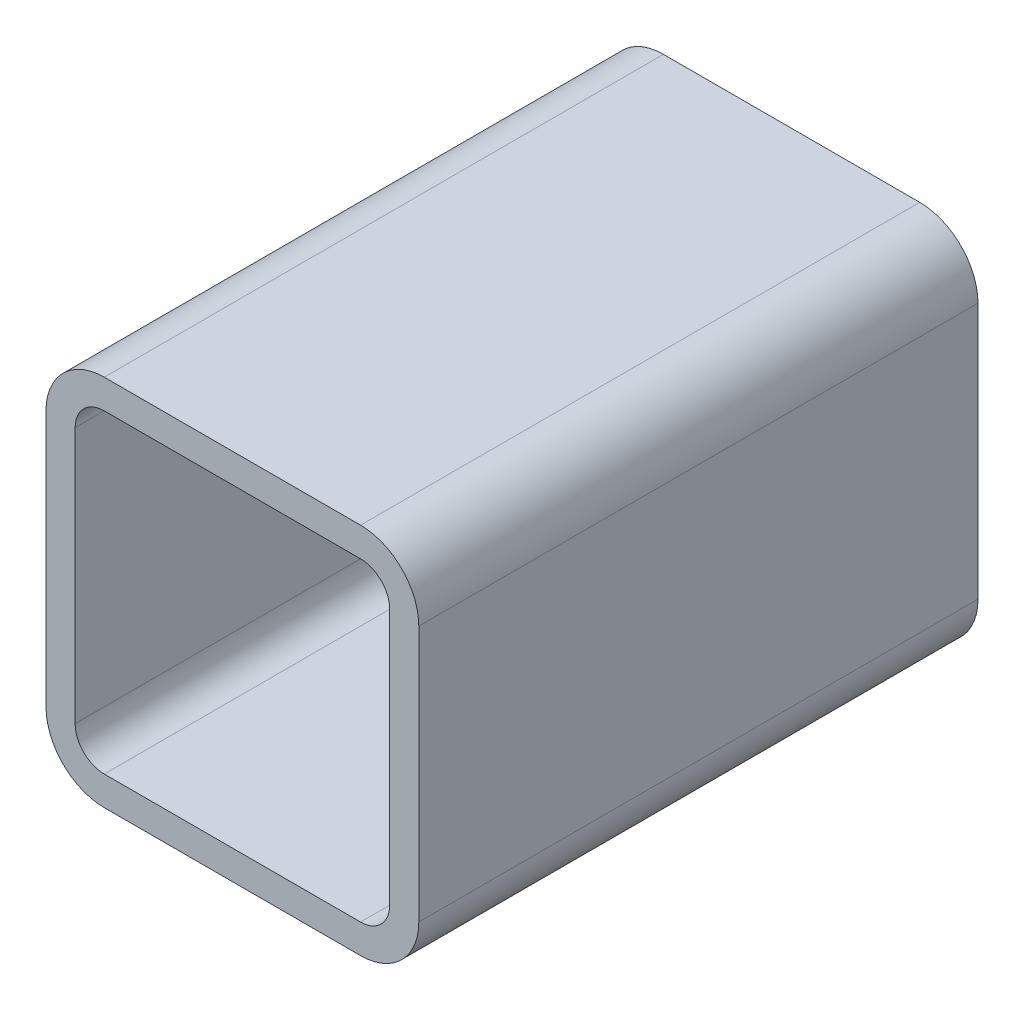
ISO-10303-21;
HEADER;
FILE_DESCRIPTION(('STEP AP214'),'2;1');
FILE_NAME('part.step','',(''),(''),'','','');
FILE_SCHEMA(('AUTOMOTIVE_DESIGN { 1 0 10303 214 1 1 1 1 }'));
ENDSEC;
DATA;
#1=APPLICATION_CONTEXT('core data for automotive mechanical design processes');
#2=APPLICATION_PROTOCOL_DEFINITION('international standard','automotive_design',2000,#1);
#3=PRODUCT_CONTEXT('',#1,'mechanical');
#4=PRODUCT('Part','Part','',(#3));
#5=PRODUCT_RELATED_PRODUCT_CATEGORY('part','',(#4));
#6=PRODUCT_DEFINITION_FORMATION('','',#4);
#7=PRODUCT_DEFINITION_CONTEXT('part definition',#1,'design');
#8=PRODUCT_DEFINITION('design','',#6,#7);
#9=PRODUCT_DEFINITION_SHAPE('','',#8);
#10=(LENGTH_UNIT() NAMED_UNIT(*) SI_UNIT(.MILLI.,.METRE.));
#11=(NAMED_UNIT(*) PLANE_ANGLE_UNIT() SI_UNIT($,.RADIAN.));
#12=(NAMED_UNIT(*) SI_UNIT($,.STERADIAN.) SOLID_ANGLE_UNIT());
#13=UNCERTAINTY_MEASURE_WITH_UNIT(LENGTH_MEASURE(1.E-05),#10,'distance_accuracy_value','');
#14=(GEOMETRIC_REPRESENTATION_CONTEXT(3) GLOBAL_UNCERTAINTY_ASSIGNED_CONTEXT((#13)) GLOBAL_UNIT_ASSIGNED_CONTEXT((#10,
#11,#12)) REPRESENTATION_CONTEXT('',''));
#15=CARTESIAN_POINT('',(0.,0.,0.));
#16=DIRECTION('',(0.,0.,1.));
#17=DIRECTION('',(1.,0.,0.));
#18=AXIS2_PLACEMENT_3D('',#15,#16,#17);
#19=CARTESIAN_POINT('',(33.1409404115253,173.416130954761,304.8));
#20=DIRECTION('',(0.,0.,1.));
#21=DIRECTION('',(1.,0.,0.));
#22=AXIS2_PLACEMENT_3D('',#19,#20,#21);
#23=PLANE('',#22);
#24=CARTESIAN_POINT('',(33.1409404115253,173.416130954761,304.8));
#25=DIRECTION('',(0.,0.,1.));
#26=DIRECTION('',(1.,0.,0.));
#27=AXIS2_PLACEMENT_3D('',#24,#25,#26);
#28=CIRCLE('',#27,31.75);
#29=CARTESIAN_POINT('',(33.1409404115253,205.166130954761,304.8));
#30=VERTEX_POINT('',#29);
#31=CARTESIAN_POINT('',(1.3909404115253,173.416130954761,304.8));
#32=VERTEX_POINT('',#31);
#33=EDGE_CURVE('E211',#30,#32,#28,.T.);
#34=ORIENTED_EDGE('',*,*,#33,.T.);
#35=DIRECTION('',(0.,-1.,0.));
#36=VECTOR('',#35,1.);
#37=CARTESIAN_POINT('',(1.3909404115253,33.7161309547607,304.8));
#38=LINE('',#37,#36);
#39=CARTESIAN_POINT('',(1.3909404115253,33.7161309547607,304.8));
#40=VERTEX_POINT('',#39);
#41=EDGE_CURVE('E214',#32,#40,#38,.T.);
#42=ORIENTED_EDGE('',*,*,#41,.T.);
#43=CARTESIAN_POINT('',(33.1409404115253,33.7161309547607,304.8));
#44=DIRECTION('',(0.,0.,1.));
#45=DIRECTION('',(1.,0.,0.));
#46=AXIS2_PLACEMENT_3D('',#43,#44,#45);
#47=CIRCLE('',#46,31.75);
#48=CARTESIAN_POINT('',(33.1409404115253,1.96613095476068,304.8));
#49=VERTEX_POINT('',#48);
#50=EDGE_CURVE('E217',#40,#49,#47,.T.);
#51=ORIENTED_EDGE('',*,*,#50,.T.);
#52=DIRECTION('',(1.,0.,0.));
#53=VECTOR('',#52,1.);
#54=CARTESIAN_POINT('',(172.840940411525,1.96613095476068,304.8));
#55=LINE('',#54,#53);
#56=CARTESIAN_POINT('',(172.840940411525,1.96613095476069,304.8));
#57=VERTEX_POINT('',#56);
#58=EDGE_CURVE('E219',#49,#57,#55,.T.);
#59=ORIENTED_EDGE('',*,*,#58,.T.);
#60=CARTESIAN_POINT('',(172.840940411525,33.7161309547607,304.8));
#61=DIRECTION('',(0.,0.,1.));
#62=DIRECTION('',(1.,0.,0.));
#63=AXIS2_PLACEMENT_3D('',#60,#61,#62);
#64=CIRCLE('',#63,31.75);
#65=CARTESIAN_POINT('',(204.590940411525,33.7161309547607,304.8));
#66=VERTEX_POINT('',#65);
#67=EDGE_CURVE('E221',#57,#66,#64,.T.);
#68=ORIENTED_EDGE('',*,*,#67,.T.);
#69=DIRECTION('',(0.,1.,0.));
#70=VECTOR('',#69,1.);
#71=CARTESIAN_POINT('',(204.590940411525,173.416130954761,304.8));
#72=LINE('',#71,#70);
#73=CARTESIAN_POINT('',(204.590940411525,173.416130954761,304.8));
#74=VERTEX_POINT('',#73);
#75=EDGE_CURVE('E223',#66,#74,#72,.T.);
#76=ORIENTED_EDGE('',*,*,#75,.T.);
#77=CARTESIAN_POINT('',(172.840940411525,173.416130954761,304.8));
#78=DIRECTION('',(0.,0.,1.));
#79=DIRECTION('',(1.,0.,0.));
#80=AXIS2_PLACEMENT_3D('',#77,#78,#79);
#81=CIRCLE('',#80,31.75);
#82=CARTESIAN_POINT('',(172.840940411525,205.166130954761,304.8));
#83=VERTEX_POINT('',#82);
#84=EDGE_CURVE('E225',#74,#83,#81,.T.);
#85=ORIENTED_EDGE('',*,*,#84,.T.);
#86=DIRECTION('',(-1.,0.,0.));
#87=VECTOR('',#86,1.);
#88=CARTESIAN_POINT('',(33.1409404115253,205.166130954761,304.8));
#89=LINE('',#88,#87);
#90=EDGE_CURVE('E227',#83,#30,#89,.T.);
#91=ORIENTED_EDGE('',*,*,#90,.T.);
#92=EDGE_LOOP('',(#34,#42,#51,#59,#68,#76,#85,#91));
#93=FACE_BOUND('',#92,.T.);
#94=DIRECTION('',(0.,-1.,0.));
#95=VECTOR('',#94,1.);
#96=CARTESIAN_POINT('',(17.2659404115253,33.7161309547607,304.8));
#97=LINE('',#96,#95);
#98=CARTESIAN_POINT('',(17.2659404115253,173.416130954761,304.8));
#99=VERTEX_POINT('',#98);
#100=CARTESIAN_POINT('',(17.2659404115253,33.7161309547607,304.8));
#101=VERTEX_POINT('',#100);
#102=EDGE_CURVE('E154',#99,#101,#97,.T.);
#103=ORIENTED_EDGE('',*,*,#102,.F.);
#104=CARTESIAN_POINT('',(33.1409404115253,173.416130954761,304.8));
#105=DIRECTION('',(0.,0.,1.));
#106=DIRECTION('',(1.,0.,0.));
#107=AXIS2_PLACEMENT_3D('',#104,#105,#106);
#108=CIRCLE('',#107,15.875);
#109=CARTESIAN_POINT('',(33.1409404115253,189.291130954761,304.8));
#110=VERTEX_POINT('',#109);
#111=EDGE_CURVE('E146',#110,#99,#108,.T.);
#112=ORIENTED_EDGE('',*,*,#111,.F.);
#113=DIRECTION('',(-1.,0.,0.));
#114=VECTOR('',#113,1.);
#115=CARTESIAN_POINT('',(33.1409404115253,189.291130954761,304.8));
#116=LINE('',#115,#114);
#117=CARTESIAN_POINT('',(172.840940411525,189.291130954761,304.8));
#118=VERTEX_POINT('',#117);
#119=EDGE_CURVE('E179',#118,#110,#116,.T.);
#120=ORIENTED_EDGE('',*,*,#119,.F.);
#121=CARTESIAN_POINT('',(172.840940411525,173.416130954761,304.8));
#122=DIRECTION('',(0.,0.,1.));
#123=DIRECTION('',(1.,0.,0.));
#124=AXIS2_PLACEMENT_3D('',#121,#122,#123);
#125=CIRCLE('',#124,15.875);
#126=CARTESIAN_POINT('',(188.715940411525,173.416130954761,304.8));
#127=VERTEX_POINT('',#126);
#128=EDGE_CURVE('E177',#127,#118,#125,.T.);
#129=ORIENTED_EDGE('',*,*,#128,.F.);
#130=DIRECTION('',(0.,1.,0.));
#131=VECTOR('',#130,1.);
#132=CARTESIAN_POINT('',(188.715940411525,173.416130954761,304.8));
#133=LINE('',#132,#131);
#134=CARTESIAN_POINT('',(188.715940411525,33.7161309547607,304.8));
#135=VERTEX_POINT('',#134);
#136=EDGE_CURVE('E175',#135,#127,#133,.T.);
#137=ORIENTED_EDGE('',*,*,#136,.F.);
#138=CARTESIAN_POINT('',(172.840940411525,33.7161309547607,304.8));
#139=DIRECTION('',(0.,0.,1.));
#140=DIRECTION('',(1.,0.,0.));
#141=AXIS2_PLACEMENT_3D('',#138,#139,#140);
#142=CIRCLE('',#141,15.875);
#143=CARTESIAN_POINT('',(172.840940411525,17.8411309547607,304.8));
#144=VERTEX_POINT('',#143);
#145=EDGE_CURVE('E173',#144,#135,#142,.T.);
#146=ORIENTED_EDGE('',*,*,#145,.F.);
#147=DIRECTION('',(1.,0.,0.));
#148=VECTOR('',#147,1.);
#149=CARTESIAN_POINT('',(172.840940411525,17.8411309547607,304.8));
#150=LINE('',#149,#148);
#151=CARTESIAN_POINT('',(33.1409404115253,17.8411309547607,304.8));
#152=VERTEX_POINT('',#151);
#153=EDGE_CURVE('E169',#152,#144,#150,.T.);
#154=ORIENTED_EDGE('',*,*,#153,.F.);
#155=CARTESIAN_POINT('',(33.1409404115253,33.7161309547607,304.8));
#156=DIRECTION('',(0.,0.,1.));
#157=DIRECTION('',(1.,0.,0.));
#158=AXIS2_PLACEMENT_3D('',#155,#156,#157);
#159=CIRCLE('',#158,15.875);
#160=EDGE_CURVE('E167',#101,#152,#159,.T.);
#161=ORIENTED_EDGE('',*,*,#160,.F.);
#162=EDGE_LOOP('',(#103,#112,#120,#129,#137,#146,#154,#161));
#163=FACE_BOUND('',#162,.T.);
#164=ADVANCED_FACE('F33',(#93,#163),#23,.T.);
#165=CARTESIAN_POINT('',(33.1409404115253,173.416130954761,0.));
#166=DIRECTION('',(0.,0.,1.));
#167=DIRECTION('',(1.,0.,0.));
#168=AXIS2_PLACEMENT_3D('',#165,#166,#167);
#169=PLANE('',#168);
#170=CARTESIAN_POINT('',(33.1409404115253,173.416130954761,0.));
#171=DIRECTION('',(0.,0.,1.));
#172=DIRECTION('',(1.,0.,0.));
#173=AXIS2_PLACEMENT_3D('',#170,#171,#172);
#174=CIRCLE('',#173,31.75);
#175=CARTESIAN_POINT('',(33.1409404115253,205.166130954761,0.));
#176=VERTEX_POINT('',#175);
#177=CARTESIAN_POINT('',(1.3909404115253,173.416130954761,0.));
#178=VERTEX_POINT('',#177);
#179=EDGE_CURVE('E162',#176,#178,#174,.T.);
#180=ORIENTED_EDGE('',*,*,#179,.F.);
#181=DIRECTION('',(-1.,0.,0.));
#182=VECTOR('',#181,1.);
#183=CARTESIAN_POINT('',(33.1409404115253,205.166130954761,0.));
#184=LINE('',#183,#182);
#185=CARTESIAN_POINT('',(172.840940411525,205.166130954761,0.));
#186=VERTEX_POINT('',#185);
#187=EDGE_CURVE('E215',#186,#176,#184,.T.);
#188=ORIENTED_EDGE('',*,*,#187,.F.);
#189=CARTESIAN_POINT('',(172.840940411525,173.416130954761,0.));
#190=DIRECTION('',(0.,0.,1.));
#191=DIRECTION('',(1.,0.,0.));
#192=AXIS2_PLACEMENT_3D('',#189,#190,#191);
#193=CIRCLE('',#192,31.75);
#194=CARTESIAN_POINT('',(204.590940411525,173.416130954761,0.));
#195=VERTEX_POINT('',#194);
#196=EDGE_CURVE('E242',#195,#186,#193,.T.);
#197=ORIENTED_EDGE('',*,*,#196,.F.);
#198=DIRECTION('',(0.,1.,0.));
#199=VECTOR('',#198,1.);
#200=CARTESIAN_POINT('',(204.590940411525,173.416130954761,0.));
#201=LINE('',#200,#199);
#202=CARTESIAN_POINT('',(204.590940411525,33.7161309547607,0.));
#203=VERTEX_POINT('',#202);
#204=EDGE_CURVE('E240',#203,#195,#201,.T.);
#205=ORIENTED_EDGE('',*,*,#204,.F.);
#206=CARTESIAN_POINT('',(172.840940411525,33.7161309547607,0.));
#207=DIRECTION('',(0.,0.,1.));
#208=DIRECTION('',(1.,0.,0.));
#209=AXIS2_PLACEMENT_3D('',#206,#207,#208);
#210=CIRCLE('',#209,31.75);
#211=CARTESIAN_POINT('',(172.840940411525,1.96613095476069,0.));
#212=VERTEX_POINT('',#211);
#213=EDGE_CURVE('E238',#212,#203,#210,.T.);
#214=ORIENTED_EDGE('',*,*,#213,.F.);
#215=DIRECTION('',(1.,0.,0.));
#216=VECTOR('',#215,1.);
#217=CARTESIAN_POINT('',(172.840940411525,1.96613095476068,0.));
#218=LINE('',#217,#216);
#219=CARTESIAN_POINT('',(33.1409404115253,1.96613095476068,0.));
#220=VERTEX_POINT('',#219);
#221=EDGE_CURVE('E236',#220,#212,#218,.T.);
#222=ORIENTED_EDGE('',*,*,#221,.F.);
#223=CARTESIAN_POINT('',(33.1409404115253,33.7161309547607,0.));
#224=DIRECTION('',(0.,0.,1.));
#225=DIRECTION('',(1.,0.,0.));
#226=AXIS2_PLACEMENT_3D('',#223,#224,#225);
#227=CIRCLE('',#226,31.75);
#228=CARTESIAN_POINT('',(1.3909404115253,33.7161309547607,0.));
#229=VERTEX_POINT('',#228);
#230=EDGE_CURVE('E234',#229,#220,#227,.T.);
#231=ORIENTED_EDGE('',*,*,#230,.F.);
#232=DIRECTION('',(0.,-1.,0.));
#233=VECTOR('',#232,1.);
#234=CARTESIAN_POINT('',(1.3909404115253,33.7161309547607,0.));
#235=LINE('',#234,#233);
#236=EDGE_CURVE('E232',#178,#229,#235,.T.);
#237=ORIENTED_EDGE('',*,*,#236,.F.);
#238=EDGE_LOOP('',(#180,#188,#197,#205,#214,#222,#231,#237));
#239=FACE_BOUND('',#238,.T.);
#240=CARTESIAN_POINT('',(33.1409404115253,173.416130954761,0.));
#241=DIRECTION('',(0.,0.,1.));
#242=DIRECTION('',(1.,0.,0.));
#243=AXIS2_PLACEMENT_3D('',#240,#241,#242);
#244=CIRCLE('',#243,15.875);
#245=CARTESIAN_POINT('',(33.1409404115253,189.291130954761,0.));
#246=VERTEX_POINT('',#245);
#247=CARTESIAN_POINT('',(17.2659404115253,173.416130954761,0.));
#248=VERTEX_POINT('',#247);
#249=EDGE_CURVE('E56',#246,#248,#244,.T.);
#250=ORIENTED_EDGE('',*,*,#249,.T.);
#251=DIRECTION('',(0.,-1.,0.));
#252=VECTOR('',#251,1.);
#253=CARTESIAN_POINT('',(17.2659404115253,33.7161309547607,0.));
#254=LINE('',#253,#252);
#255=CARTESIAN_POINT('',(17.2659404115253,33.7161309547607,0.));
#256=VERTEX_POINT('',#255);
#257=EDGE_CURVE('E161',#248,#256,#254,.T.);
#258=ORIENTED_EDGE('',*,*,#257,.T.);
#259=CARTESIAN_POINT('',(33.1409404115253,33.7161309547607,0.));
#260=DIRECTION('',(0.,0.,1.));
#261=DIRECTION('',(1.,0.,0.));
#262=AXIS2_PLACEMENT_3D('',#259,#260,#261);
#263=CIRCLE('',#262,15.875);
#264=CARTESIAN_POINT('',(33.1409404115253,17.8411309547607,0.));
#265=VERTEX_POINT('',#264);
#266=EDGE_CURVE('E183',#256,#265,#263,.T.);
#267=ORIENTED_EDGE('',*,*,#266,.T.);
#268=DIRECTION('',(1.,0.,0.));
#269=VECTOR('',#268,1.);
#270=CARTESIAN_POINT('',(172.840940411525,17.8411309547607,0.));
#271=LINE('',#270,#269);
#272=CARTESIAN_POINT('',(172.840940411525,17.8411309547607,0.));
#273=VERTEX_POINT('',#272);
#274=EDGE_CURVE('E186',#265,#273,#271,.T.);
#275=ORIENTED_EDGE('',*,*,#274,.T.);
#276=CARTESIAN_POINT('',(172.840940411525,33.7161309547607,0.));
#277=DIRECTION('',(0.,0.,1.));
#278=DIRECTION('',(1.,0.,0.));
#279=AXIS2_PLACEMENT_3D('',#276,#277,#278);
#280=CIRCLE('',#279,15.875);
#281=CARTESIAN_POINT('',(188.715940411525,33.7161309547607,0.));
#282=VERTEX_POINT('',#281);
#283=EDGE_CURVE('E189',#273,#282,#280,.T.);
#284=ORIENTED_EDGE('',*,*,#283,.T.);
#285=DIRECTION('',(0.,1.,0.));
#286=VECTOR('',#285,1.);
#287=CARTESIAN_POINT('',(188.715940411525,173.416130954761,0.));
#288=LINE('',#287,#286);
#289=CARTESIAN_POINT('',(188.715940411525,173.416130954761,0.));
#290=VERTEX_POINT('',#289);
#291=EDGE_CURVE('E192',#282,#290,#288,.T.);
#292=ORIENTED_EDGE('',*,*,#291,.T.);
#293=CARTESIAN_POINT('',(172.840940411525,173.416130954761,0.));
#294=DIRECTION('',(0.,0.,1.));
#295=DIRECTION('',(1.,0.,0.));
#296=AXIS2_PLACEMENT_3D('',#293,#294,#295);
#297=CIRCLE('',#296,15.875);
#298=CARTESIAN_POINT('',(172.840940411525,189.291130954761,0.));
#299=VERTEX_POINT('',#298);
#300=EDGE_CURVE('E195',#290,#299,#297,.T.);
#301=ORIENTED_EDGE('',*,*,#300,.T.);
#302=DIRECTION('',(-1.,0.,0.));
#303=VECTOR('',#302,1.);
#304=CARTESIAN_POINT('',(33.1409404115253,189.291130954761,0.));
#305=LINE('',#304,#303);
#306=EDGE_CURVE('E155',#299,#246,#305,.T.);
#307=ORIENTED_EDGE('',*,*,#306,.T.);
#308=EDGE_LOOP('',(#250,#258,#267,#275,#284,#292,#301,#307));
#309=FACE_BOUND('',#308,.T.);
#310=ADVANCED_FACE('F272',(#239,#309),#169,.F.);
#311=CARTESIAN_POINT('',(33.1409404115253,173.416130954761,304.8));
#312=DIRECTION('',(0.,0.,-1.));
#313=DIRECTION('',(-1.,0.,0.));
#314=AXIS2_PLACEMENT_3D('',#311,#312,#313);
#315=CYLINDRICAL_SURFACE('',#314,31.75);
#316=ORIENTED_EDGE('',*,*,#179,.T.);
#317=DIRECTION('',(0.,0.,-1.));
#318=VECTOR('',#317,1.);
#319=CARTESIAN_POINT('',(1.3909404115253,173.416130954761,304.8));
#320=LINE('',#319,#318);
#321=EDGE_CURVE('E11',#32,#178,#320,.T.);
#322=ORIENTED_EDGE('',*,*,#321,.F.);
#323=ORIENTED_EDGE('',*,*,#33,.F.);
#324=DIRECTION('',(0.,0.,-1.));
#325=VECTOR('',#324,1.);
#326=CARTESIAN_POINT('',(33.1409404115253,205.166130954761,304.8));
#327=LINE('',#326,#325);
#328=EDGE_CURVE('E229',#30,#176,#327,.T.);
#329=ORIENTED_EDGE('',*,*,#328,.T.);
#330=EDGE_LOOP('',(#316,#322,#323,#329));
#331=FACE_BOUND('',#330,.T.);
#332=ADVANCED_FACE('F35',(#331),#315,.T.);
#333=CARTESIAN_POINT('',(1.3909404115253,33.7161309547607,304.8));
#334=DIRECTION('',(1.,0.,0.));
#335=DIRECTION('',(0.,0.,-1.));
#336=AXIS2_PLACEMENT_3D('',#333,#334,#335);
#337=PLANE('',#336);
#338=ORIENTED_EDGE('',*,*,#236,.T.);
#339=DIRECTION('',(0.,0.,-1.));
#340=VECTOR('',#339,1.);
#341=CARTESIAN_POINT('',(1.3909404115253,33.7161309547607,304.8));
#342=LINE('',#341,#340);
#343=EDGE_CURVE('E41',#40,#229,#342,.T.);
#344=ORIENTED_EDGE('',*,*,#343,.F.);
#345=ORIENTED_EDGE('',*,*,#41,.F.);
#346=ORIENTED_EDGE('',*,*,#321,.T.);
#347=EDGE_LOOP('',(#338,#344,#345,#346));
#348=FACE_BOUND('',#347,.T.);
#349=ADVANCED_FACE('F289',(#348),#337,.F.);
#350=CARTESIAN_POINT('',(33.1409404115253,33.7161309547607,304.8));
#351=DIRECTION('',(0.,0.,-1.));
#352=DIRECTION('',(-1.,0.,0.));
#353=AXIS2_PLACEMENT_3D('',#350,#351,#352);
#354=CYLINDRICAL_SURFACE('',#353,31.75);
#355=ORIENTED_EDGE('',*,*,#230,.T.);
#356=DIRECTION('',(0.,0.,-1.));
#357=VECTOR('',#356,1.);
#358=CARTESIAN_POINT('',(33.1409404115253,1.96613095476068,304.8));
#359=LINE('',#358,#357);
#360=EDGE_CURVE('E259',#49,#220,#359,.T.);
#361=ORIENTED_EDGE('',*,*,#360,.F.);
#362=ORIENTED_EDGE('',*,*,#50,.F.);
#363=ORIENTED_EDGE('',*,*,#343,.T.);
#364=EDGE_LOOP('',(#355,#361,#362,#363));
#365=FACE_BOUND('',#364,.T.);
#366=ADVANCED_FACE('F266',(#365),#354,.T.);
#367=CARTESIAN_POINT('',(172.840940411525,1.96613095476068,304.8));
#368=DIRECTION('',(0.,1.,0.));
#369=DIRECTION('',(0.,0.,1.));
#370=AXIS2_PLACEMENT_3D('',#367,#368,#369);
#371=PLANE('',#370);
#372=ORIENTED_EDGE('',*,*,#221,.T.);
#373=DIRECTION('',(0.,0.,-1.));
#374=VECTOR('',#373,1.);
#375=CARTESIAN_POINT('',(172.840940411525,1.96613095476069,304.8));
#376=LINE('',#375,#374);
#377=EDGE_CURVE('E256',#57,#212,#376,.T.);
#378=ORIENTED_EDGE('',*,*,#377,.F.);
#379=ORIENTED_EDGE('',*,*,#58,.F.);
#380=ORIENTED_EDGE('',*,*,#360,.T.);
#381=EDGE_LOOP('',(#372,#378,#379,#380));
#382=FACE_BOUND('',#381,.T.);
#383=ADVANCED_FACE('F278',(#382),#371,.F.);
#384=CARTESIAN_POINT('',(172.840940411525,33.7161309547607,304.8));
#385=DIRECTION('',(0.,0.,-1.));
#386=DIRECTION('',(-1.,0.,0.));
#387=AXIS2_PLACEMENT_3D('',#384,#385,#386);
#388=CYLINDRICAL_SURFACE('',#387,31.75);
#389=ORIENTED_EDGE('',*,*,#213,.T.);
#390=DIRECTION('',(0.,0.,-1.));
#391=VECTOR('',#390,1.);
#392=CARTESIAN_POINT('',(204.590940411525,33.7161309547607,304.8));
#393=LINE('',#392,#391);
#394=EDGE_CURVE('E253',#66,#203,#393,.T.);
#395=ORIENTED_EDGE('',*,*,#394,.F.);
#396=ORIENTED_EDGE('',*,*,#67,.F.);
#397=ORIENTED_EDGE('',*,*,#377,.T.);
#398=EDGE_LOOP('',(#389,#395,#396,#397));
#399=FACE_BOUND('',#398,.T.);
#400=ADVANCED_FACE('F282',(#399),#388,.T.);
#401=CARTESIAN_POINT('',(204.590940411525,173.416130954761,304.8));
#402=DIRECTION('',(-1.,0.,0.));
#403=DIRECTION('',(0.,0.,1.));
#404=AXIS2_PLACEMENT_3D('',#401,#402,#403);
#405=PLANE('',#404);
#406=ORIENTED_EDGE('',*,*,#204,.T.);
#407=DIRECTION('',(0.,0.,-1.));
#408=VECTOR('',#407,1.);
#409=CARTESIAN_POINT('',(204.590940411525,173.416130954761,304.8));
#410=LINE('',#409,#408);
#411=EDGE_CURVE('E250',#74,#195,#410,.T.);
#412=ORIENTED_EDGE('',*,*,#411,.F.);
#413=ORIENTED_EDGE('',*,*,#75,.F.);
#414=ORIENTED_EDGE('',*,*,#394,.T.);
#415=EDGE_LOOP('',(#406,#412,#413,#414));
#416=FACE_BOUND('',#415,.T.);
#417=ADVANCED_FACE('F302',(#416),#405,.F.);
#418=CARTESIAN_POINT('',(172.840940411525,173.416130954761,304.8));
#419=DIRECTION('',(0.,0.,-1.));
#420=DIRECTION('',(-1.,0.,0.));
#421=AXIS2_PLACEMENT_3D('',#418,#419,#420);
#422=CYLINDRICAL_SURFACE('',#421,31.75);
#423=ORIENTED_EDGE('',*,*,#196,.T.);
#424=DIRECTION('',(0.,0.,-1.));
#425=VECTOR('',#424,1.);
#426=CARTESIAN_POINT('',(172.840940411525,205.166130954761,304.8));
#427=LINE('',#426,#425);
#428=EDGE_CURVE('E247',#83,#186,#427,.T.);
#429=ORIENTED_EDGE('',*,*,#428,.F.);
#430=ORIENTED_EDGE('',*,*,#84,.F.);
#431=ORIENTED_EDGE('',*,*,#411,.T.);
#432=EDGE_LOOP('',(#423,#429,#430,#431));
#433=FACE_BOUND('',#432,.T.);
#434=ADVANCED_FACE('F300',(#433),#422,.T.);
#435=CARTESIAN_POINT('',(33.1409404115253,205.166130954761,304.8));
#436=DIRECTION('',(0.,-1.,0.));
#437=DIRECTION('',(0.,0.,-1.));
#438=AXIS2_PLACEMENT_3D('',#435,#436,#437);
#439=PLANE('',#438);
#440=ORIENTED_EDGE('',*,*,#187,.T.);
#441=ORIENTED_EDGE('',*,*,#328,.F.);
#442=ORIENTED_EDGE('',*,*,#90,.F.);
#443=ORIENTED_EDGE('',*,*,#428,.T.);
#444=EDGE_LOOP('',(#440,#441,#442,#443));
#445=FACE_BOUND('',#444,.T.);
#446=ADVANCED_FACE('F295',(#445),#439,.F.);
#447=CARTESIAN_POINT('',(33.1409404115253,173.416130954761,304.8));
#448=DIRECTION('',(0.,0.,-1.));
#449=DIRECTION('',(-1.,0.,0.));
#450=AXIS2_PLACEMENT_3D('',#447,#448,#449);
#451=CYLINDRICAL_SURFACE('',#450,15.875);
#452=ORIENTED_EDGE('',*,*,#249,.F.);
#453=DIRECTION('',(0.,0.,-1.));
#454=VECTOR('',#453,1.);
#455=CARTESIAN_POINT('',(33.1409404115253,189.291130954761,304.8));
#456=LINE('',#455,#454);
#457=EDGE_CURVE('E150',#110,#246,#456,.T.);
#458=ORIENTED_EDGE('',*,*,#457,.F.);
#459=ORIENTED_EDGE('',*,*,#111,.T.);
#460=DIRECTION('',(0.,0.,-1.));
#461=VECTOR('',#460,1.);
#462=CARTESIAN_POINT('',(17.2659404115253,173.416130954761,304.8));
#463=LINE('',#462,#461);
#464=EDGE_CURVE('E149',#99,#248,#463,.T.);
#465=ORIENTED_EDGE('',*,*,#464,.T.);
#466=EDGE_LOOP('',(#452,#458,#459,#465));
#467=FACE_BOUND('',#466,.T.);
#468=ADVANCED_FACE('F148',(#467),#451,.F.);
#469=CARTESIAN_POINT('',(17.2659404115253,33.7161309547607,304.8));
#470=DIRECTION('',(1.,0.,0.));
#471=DIRECTION('',(0.,0.,-1.));
#472=AXIS2_PLACEMENT_3D('',#469,#470,#471);
#473=PLANE('',#472);
#474=ORIENTED_EDGE('',*,*,#257,.F.);
#475=ORIENTED_EDGE('',*,*,#464,.F.);
#476=ORIENTED_EDGE('',*,*,#102,.T.);
#477=DIRECTION('',(0.,0.,-1.));
#478=VECTOR('',#477,1.);
#479=CARTESIAN_POINT('',(17.2659404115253,33.7161309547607,304.8));
#480=LINE('',#479,#478);
#481=EDGE_CURVE('E163',#101,#256,#480,.T.);
#482=ORIENTED_EDGE('',*,*,#481,.T.);
#483=EDGE_LOOP('',(#474,#475,#476,#482));
#484=FACE_BOUND('',#483,.T.);
#485=ADVANCED_FACE('F158',(#484),#473,.T.);
#486=CARTESIAN_POINT('',(33.1409404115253,33.7161309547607,304.8));
#487=DIRECTION('',(0.,0.,-1.));
#488=DIRECTION('',(-1.,0.,0.));
#489=AXIS2_PLACEMENT_3D('',#486,#487,#488);
#490=CYLINDRICAL_SURFACE('',#489,15.875);
#491=ORIENTED_EDGE('',*,*,#266,.F.);
#492=ORIENTED_EDGE('',*,*,#481,.F.);
#493=ORIENTED_EDGE('',*,*,#160,.T.);
#494=DIRECTION('',(0.,0.,-1.));
#495=VECTOR('',#494,1.);
#496=CARTESIAN_POINT('',(33.1409404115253,17.8411309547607,304.8));
#497=LINE('',#496,#495);
#498=EDGE_CURVE('E208',#152,#265,#497,.T.);
#499=ORIENTED_EDGE('',*,*,#498,.T.);
#500=EDGE_LOOP('',(#491,#492,#493,#499));
#501=FACE_BOUND('',#500,.T.);
#502=ADVANCED_FACE('F327',(#501),#490,.F.);
#503=CARTESIAN_POINT('',(172.840940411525,17.8411309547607,304.8));
#504=DIRECTION('',(0.,1.,0.));
#505=DIRECTION('',(0.,0.,1.));
#506=AXIS2_PLACEMENT_3D('',#503,#504,#505);
#507=PLANE('',#506);
#508=ORIENTED_EDGE('',*,*,#274,.F.);
#509=ORIENTED_EDGE('',*,*,#498,.F.);
#510=ORIENTED_EDGE('',*,*,#153,.T.);
#511=DIRECTION('',(0.,0.,-1.));
#512=VECTOR('',#511,1.);
#513=CARTESIAN_POINT('',(172.840940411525,17.8411309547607,304.8));
#514=LINE('',#513,#512);
#515=EDGE_CURVE('E206',#144,#273,#514,.T.);
#516=ORIENTED_EDGE('',*,*,#515,.T.);
#517=EDGE_LOOP('',(#508,#509,#510,#516));
#518=FACE_BOUND('',#517,.T.);
#519=ADVANCED_FACE('F331',(#518),#507,.T.);
#520=CARTESIAN_POINT('',(172.840940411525,33.7161309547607,304.8));
#521=DIRECTION('',(0.,0.,-1.));
#522=DIRECTION('',(-1.,0.,0.));
#523=AXIS2_PLACEMENT_3D('',#520,#521,#522);
#524=CYLINDRICAL_SURFACE('',#523,15.875);
#525=ORIENTED_EDGE('',*,*,#283,.F.);
#526=ORIENTED_EDGE('',*,*,#515,.F.);
#527=ORIENTED_EDGE('',*,*,#145,.T.);
#528=DIRECTION('',(0.,0.,-1.));
#529=VECTOR('',#528,1.);
#530=CARTESIAN_POINT('',(188.715940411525,33.7161309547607,304.8));
#531=LINE('',#530,#529);
#532=EDGE_CURVE('E204',#135,#282,#531,.T.);
#533=ORIENTED_EDGE('',*,*,#532,.T.);
#534=EDGE_LOOP('',(#525,#526,#527,#533));
#535=FACE_BOUND('',#534,.T.);
#536=ADVANCED_FACE('F337',(#535),#524,.F.);
#537=CARTESIAN_POINT('',(188.715940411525,173.416130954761,304.8));
#538=DIRECTION('',(-1.,0.,0.));
#539=DIRECTION('',(0.,0.,1.));
#540=AXIS2_PLACEMENT_3D('',#537,#538,#539);
#541=PLANE('',#540);
#542=ORIENTED_EDGE('',*,*,#291,.F.);
#543=ORIENTED_EDGE('',*,*,#532,.F.);
#544=ORIENTED_EDGE('',*,*,#136,.T.);
#545=DIRECTION('',(0.,0.,-1.));
#546=VECTOR('',#545,1.);
#547=CARTESIAN_POINT('',(188.715940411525,173.416130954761,304.8));
#548=LINE('',#547,#546);
#549=EDGE_CURVE('E202',#127,#290,#548,.T.);
#550=ORIENTED_EDGE('',*,*,#549,.T.);
#551=EDGE_LOOP('',(#542,#543,#544,#550));
#552=FACE_BOUND('',#551,.T.);
#553=ADVANCED_FACE('F341',(#552),#541,.T.);
#554=CARTESIAN_POINT('',(172.840940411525,173.416130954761,304.8));
#555=DIRECTION('',(0.,0.,-1.));
#556=DIRECTION('',(-1.,0.,0.));
#557=AXIS2_PLACEMENT_3D('',#554,#555,#556);
#558=CYLINDRICAL_SURFACE('',#557,15.875);
#559=ORIENTED_EDGE('',*,*,#300,.F.);
#560=ORIENTED_EDGE('',*,*,#549,.F.);
#561=ORIENTED_EDGE('',*,*,#128,.T.);
#562=DIRECTION('',(0.,0.,-1.));
#563=VECTOR('',#562,1.);
#564=CARTESIAN_POINT('',(172.840940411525,189.291130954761,304.8));
#565=LINE('',#564,#563);
#566=EDGE_CURVE('E48',#118,#299,#565,.T.);
#567=ORIENTED_EDGE('',*,*,#566,.T.);
#568=EDGE_LOOP('',(#559,#560,#561,#567));
#569=FACE_BOUND('',#568,.T.);
#570=ADVANCED_FACE('F345',(#569),#558,.F.);
#571=CARTESIAN_POINT('',(33.1409404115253,189.291130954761,304.8));
#572=DIRECTION('',(0.,-1.,0.));
#573=DIRECTION('',(0.,0.,-1.));
#574=AXIS2_PLACEMENT_3D('',#571,#572,#573);
#575=PLANE('',#574);
#576=ORIENTED_EDGE('',*,*,#306,.F.);
#577=ORIENTED_EDGE('',*,*,#566,.F.);
#578=ORIENTED_EDGE('',*,*,#119,.T.);
#579=ORIENTED_EDGE('',*,*,#457,.T.);
#580=EDGE_LOOP('',(#576,#577,#578,#579));
#581=FACE_BOUND('',#580,.T.);
#582=ADVANCED_FACE('F349',(#581),#575,.T.);
#583=CLOSED_SHELL('',(#164,#310,#332,#349,#366,#383,#400,#417,#434,#446,#468,#485,#502,#519,
#536,#553,#570,#582));
#584=MANIFOLD_SOLID_BREP('B2',#583);
#585=ADVANCED_BREP_SHAPE_REPRESENTATION('',(#18,#584),#14);
#586=SHAPE_DEFINITION_REPRESENTATION(#9,#585);
ENDSEC;
END-ISO-10303-21;
